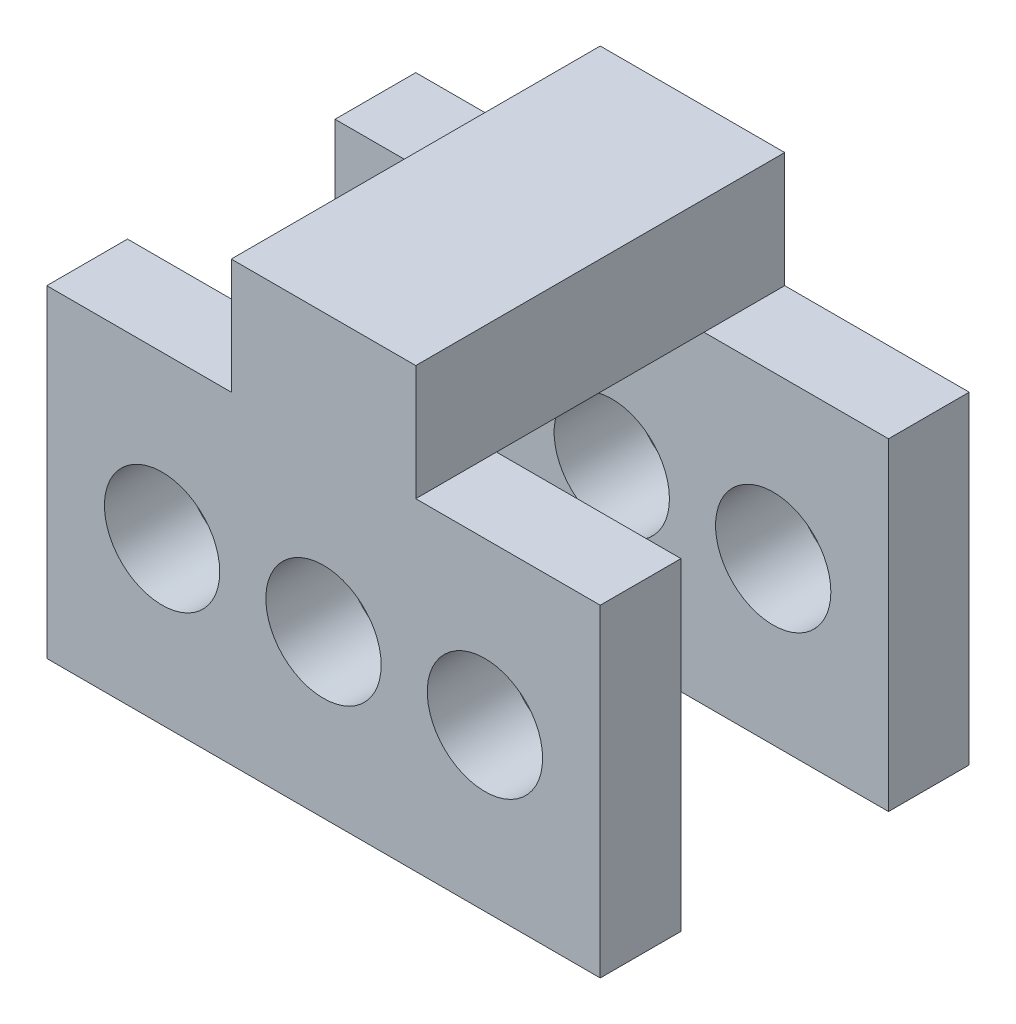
ISO-10303-21;
HEADER;
FILE_DESCRIPTION(('STEP AP214'),'2;1');
FILE_NAME('part.step','',(''),(''),'','','');
FILE_SCHEMA(('AUTOMOTIVE_DESIGN { 1 0 10303 214 1 1 1 1 }'));
ENDSEC;
DATA;
#1=APPLICATION_CONTEXT('core data for automotive mechanical design processes');
#2=APPLICATION_PROTOCOL_DEFINITION('international standard','automotive_design',2000,#1);
#3=PRODUCT_CONTEXT('',#1,'mechanical');
#4=PRODUCT('Part','Part','',(#3));
#5=PRODUCT_RELATED_PRODUCT_CATEGORY('part','',(#4));
#6=PRODUCT_DEFINITION_FORMATION('','',#4);
#7=PRODUCT_DEFINITION_CONTEXT('part definition',#1,'design');
#8=PRODUCT_DEFINITION('design','',#6,#7);
#9=PRODUCT_DEFINITION_SHAPE('','',#8);
#10=(LENGTH_UNIT() NAMED_UNIT(*) SI_UNIT(.MILLI.,.METRE.));
#11=(NAMED_UNIT(*) PLANE_ANGLE_UNIT() SI_UNIT($,.RADIAN.));
#12=(NAMED_UNIT(*) SI_UNIT($,.STERADIAN.) SOLID_ANGLE_UNIT());
#13=UNCERTAINTY_MEASURE_WITH_UNIT(LENGTH_MEASURE(1.E-05),#10,'distance_accuracy_value','');
#14=(GEOMETRIC_REPRESENTATION_CONTEXT(3) GLOBAL_UNCERTAINTY_ASSIGNED_CONTEXT((#13)) GLOBAL_UNIT_ASSIGNED_CONTEXT((#10,
#11,#12)) REPRESENTATION_CONTEXT('',''));
#15=CARTESIAN_POINT('',(0.,0.,0.));
#16=DIRECTION('',(0.,0.,1.));
#17=DIRECTION('',(1.,0.,0.));
#18=AXIS2_PLACEMENT_3D('',#15,#16,#17);
#19=CARTESIAN_POINT('',(-16.,28.,32.));
#20=DIRECTION('',(0.,1.,0.));
#21=DIRECTION('',(0.,0.,1.));
#22=AXIS2_PLACEMENT_3D('',#19,#20,#21);
#23=PLANE('',#22);
#24=DIRECTION('',(-1.,0.,0.));
#25=VECTOR('',#24,1.);
#26=CARTESIAN_POINT('',(-48.,28.,-18.));
#27=LINE('',#26,#25);
#28=CARTESIAN_POINT('',(16.,28.,-18.));
#29=VERTEX_POINT('',#28);
#30=CARTESIAN_POINT('',(-16.,28.,-18.));
#31=VERTEX_POINT('',#30);
#32=EDGE_CURVE('E58',#29,#31,#27,.T.);
#33=ORIENTED_EDGE('',*,*,#32,.F.);
#34=DIRECTION('',(0.,0.,-1.));
#35=VECTOR('',#34,1.);
#36=CARTESIAN_POINT('',(16.,28.,32.));
#37=LINE('',#36,#35);
#38=CARTESIAN_POINT('',(16.,28.,18.));
#39=VERTEX_POINT('',#38);
#40=EDGE_CURVE('E264',#39,#29,#37,.T.);
#41=ORIENTED_EDGE('',*,*,#40,.F.);
#42=DIRECTION('',(-1.,0.,0.));
#43=VECTOR('',#42,1.);
#44=CARTESIAN_POINT('',(-48.,28.,18.));
#45=LINE('',#44,#43);
#46=CARTESIAN_POINT('',(-16.,28.,18.));
#47=VERTEX_POINT('',#46);
#48=EDGE_CURVE('E11',#39,#47,#45,.T.);
#49=ORIENTED_EDGE('',*,*,#48,.T.);
#50=DIRECTION('',(0.,0.,-1.));
#51=VECTOR('',#50,1.);
#52=CARTESIAN_POINT('',(-16.,28.,32.));
#53=LINE('',#52,#51);
#54=EDGE_CURVE('E268',#47,#31,#53,.T.);
#55=ORIENTED_EDGE('',*,*,#54,.T.);
#56=EDGE_LOOP('',(#33,#41,#49,#55));
#57=FACE_BOUND('',#56,.T.);
#58=ADVANCED_FACE('F31',(#57),#23,.F.);
#59=CARTESIAN_POINT('',(16.,28.,32.));
#60=DIRECTION('',(-1.,0.,0.));
#61=DIRECTION('',(0.,-1.,0.));
#62=AXIS2_PLACEMENT_3D('',#59,#60,#61);
#63=PLANE('',#62);
#64=DIRECTION('',(0.,1.,0.));
#65=VECTOR('',#64,1.);
#66=CARTESIAN_POINT('',(16.,28.,-32.));
#67=LINE('',#66,#65);
#68=CARTESIAN_POINT('',(16.,28.,-32.));
#69=VERTEX_POINT('',#68);
#70=CARTESIAN_POINT('',(16.,48.,-32.));
#71=VERTEX_POINT('',#70);
#72=EDGE_CURVE('E248',#69,#71,#67,.T.);
#73=ORIENTED_EDGE('',*,*,#72,.T.);
#74=DIRECTION('',(0.,0.,-1.));
#75=VECTOR('',#74,1.);
#76=CARTESIAN_POINT('',(16.,48.,32.));
#77=LINE('',#76,#75);
#78=CARTESIAN_POINT('',(16.,48.,32.));
#79=VERTEX_POINT('',#78);
#80=EDGE_CURVE('E41',#79,#71,#77,.T.);
#81=ORIENTED_EDGE('',*,*,#80,.F.);
#82=DIRECTION('',(0.,1.,0.));
#83=VECTOR('',#82,1.);
#84=CARTESIAN_POINT('',(16.,28.,32.));
#85=LINE('',#84,#83);
#86=CARTESIAN_POINT('',(16.,28.,32.));
#87=VERTEX_POINT('',#86);
#88=EDGE_CURVE('E263',#87,#79,#85,.T.);
#89=ORIENTED_EDGE('',*,*,#88,.F.);
#90=EDGE_CURVE('E266',#87,#39,#37,.T.);
#91=ORIENTED_EDGE('',*,*,#90,.T.);
#92=ORIENTED_EDGE('',*,*,#40,.T.);
#93=DIRECTION('',(0.,0.,1.));
#94=VECTOR('',#93,1.);
#95=CARTESIAN_POINT('',(16.,28.,32.));
#96=LINE('',#95,#94);
#97=EDGE_CURVE('E189',#69,#29,#96,.T.);
#98=ORIENTED_EDGE('',*,*,#97,.F.);
#99=EDGE_LOOP('',(#73,#81,#89,#91,#92,#98));
#100=FACE_BOUND('',#99,.T.);
#101=ADVANCED_FACE('F33',(#100),#63,.F.);
#102=CARTESIAN_POINT('',(16.,48.,32.));
#103=DIRECTION('',(0.,-1.,0.));
#104=DIRECTION('',(0.,0.,-1.));
#105=AXIS2_PLACEMENT_3D('',#102,#103,#104);
#106=PLANE('',#105);
#107=DIRECTION('',(-1.,0.,0.));
#108=VECTOR('',#107,1.);
#109=CARTESIAN_POINT('',(16.,48.,-32.));
#110=LINE('',#109,#108);
#111=CARTESIAN_POINT('',(-16.,48.,-32.));
#112=VERTEX_POINT('',#111);
#113=EDGE_CURVE('E253',#71,#112,#110,.T.);
#114=ORIENTED_EDGE('',*,*,#113,.T.);
#115=DIRECTION('',(0.,0.,-1.));
#116=VECTOR('',#115,1.);
#117=CARTESIAN_POINT('',(-16.,48.,32.));
#118=LINE('',#117,#116);
#119=CARTESIAN_POINT('',(-16.,48.,32.));
#120=VERTEX_POINT('',#119);
#121=EDGE_CURVE('E291',#120,#112,#118,.T.);
#122=ORIENTED_EDGE('',*,*,#121,.F.);
#123=DIRECTION('',(-1.,0.,0.));
#124=VECTOR('',#123,1.);
#125=CARTESIAN_POINT('',(16.,48.,32.));
#126=LINE('',#125,#124);
#127=EDGE_CURVE('E260',#79,#120,#126,.T.);
#128=ORIENTED_EDGE('',*,*,#127,.F.);
#129=ORIENTED_EDGE('',*,*,#80,.T.);
#130=EDGE_LOOP('',(#114,#122,#128,#129));
#131=FACE_BOUND('',#130,.T.);
#132=ADVANCED_FACE('F292',(#131),#106,.F.);
#133=CARTESIAN_POINT('',(-16.,48.,32.));
#134=DIRECTION('',(1.,0.,0.));
#135=DIRECTION('',(0.,1.,0.));
#136=AXIS2_PLACEMENT_3D('',#133,#134,#135);
#137=PLANE('',#136);
#138=DIRECTION('',(0.,-1.,0.));
#139=VECTOR('',#138,1.);
#140=CARTESIAN_POINT('',(-16.,48.,-32.));
#141=LINE('',#140,#139);
#142=CARTESIAN_POINT('',(-16.,28.,-32.));
#143=VERTEX_POINT('',#142);
#144=EDGE_CURVE('E258',#112,#143,#141,.T.);
#145=ORIENTED_EDGE('',*,*,#144,.T.);
#146=DIRECTION('',(0.,0.,-1.));
#147=VECTOR('',#146,1.);
#148=CARTESIAN_POINT('',(-16.,28.,32.));
#149=LINE('',#148,#147);
#150=EDGE_CURVE('E51',#31,#143,#149,.T.);
#151=ORIENTED_EDGE('',*,*,#150,.F.);
#152=ORIENTED_EDGE('',*,*,#54,.F.);
#153=CARTESIAN_POINT('',(-16.,28.,32.));
#154=VERTEX_POINT('',#153);
#155=EDGE_CURVE('E35',#154,#47,#53,.T.);
#156=ORIENTED_EDGE('',*,*,#155,.F.);
#157=DIRECTION('',(0.,-1.,0.));
#158=VECTOR('',#157,1.);
#159=CARTESIAN_POINT('',(-16.,48.,32.));
#160=LINE('',#159,#158);
#161=EDGE_CURVE('E267',#120,#154,#160,.T.);
#162=ORIENTED_EDGE('',*,*,#161,.F.);
#163=ORIENTED_EDGE('',*,*,#121,.T.);
#164=EDGE_LOOP('',(#145,#151,#152,#156,#162,#163));
#165=FACE_BOUND('',#164,.T.);
#166=ADVANCED_FACE('F294',(#165),#137,.F.);
#167=CARTESIAN_POINT('',(16.,48.,32.));
#168=DIRECTION('',(0.,0.,1.));
#169=DIRECTION('',(1.,0.,0.));
#170=AXIS2_PLACEMENT_3D('',#167,#168,#169);
#171=PLANE('',#170);
#172=ORIENTED_EDGE('',*,*,#88,.T.);
#173=ORIENTED_EDGE('',*,*,#127,.T.);
#174=ORIENTED_EDGE('',*,*,#161,.T.);
#175=DIRECTION('',(-1.,0.,0.));
#176=VECTOR('',#175,1.);
#177=CARTESIAN_POINT('',(-48.,28.,32.));
#178=LINE('',#177,#176);
#179=CARTESIAN_POINT('',(-48.,28.,32.));
#180=VERTEX_POINT('',#179);
#181=EDGE_CURVE('E231',#154,#180,#178,.T.);
#182=ORIENTED_EDGE('',*,*,#181,.T.);
#183=DIRECTION('',(0.,-1.,0.));
#184=VECTOR('',#183,1.);
#185=CARTESIAN_POINT('',(-48.,28.,32.));
#186=LINE('',#185,#184);
#187=CARTESIAN_POINT('',(-48.,-28.,32.));
#188=VERTEX_POINT('',#187);
#189=EDGE_CURVE('E208',#180,#188,#186,.T.);
#190=ORIENTED_EDGE('',*,*,#189,.T.);
#191=DIRECTION('',(1.,0.,0.));
#192=VECTOR('',#191,1.);
#193=CARTESIAN_POINT('',(-48.,-28.,32.));
#194=LINE('',#193,#192);
#195=CARTESIAN_POINT('',(48.,-28.,32.));
#196=VERTEX_POINT('',#195);
#197=EDGE_CURVE('E225',#188,#196,#194,.T.);
#198=ORIENTED_EDGE('',*,*,#197,.T.);
#199=DIRECTION('',(0.,1.,0.));
#200=VECTOR('',#199,1.);
#201=CARTESIAN_POINT('',(48.,28.,32.));
#202=LINE('',#201,#200);
#203=CARTESIAN_POINT('',(48.,28.,32.));
#204=VERTEX_POINT('',#203);
#205=EDGE_CURVE('E228',#196,#204,#202,.T.);
#206=ORIENTED_EDGE('',*,*,#205,.T.);
#207=EDGE_CURVE('E215',#204,#87,#178,.T.);
#208=ORIENTED_EDGE('',*,*,#207,.T.);
#209=EDGE_LOOP('',(#172,#173,#174,#182,#190,#198,#206,#208));
#210=FACE_BOUND('',#209,.T.);
#211=CARTESIAN_POINT('',(28.,0.,32.));
#212=DIRECTION('',(0.,0.,1.));
#213=DIRECTION('',(1.,0.,0.));
#214=AXIS2_PLACEMENT_3D('',#211,#212,#213);
#215=CIRCLE('',#214,10.);
#216=CARTESIAN_POINT('',(38.,0.,32.));
#217=VERTEX_POINT('',#216);
#218=EDGE_CURVE('E192',#217,#217,#215,.T.);
#219=ORIENTED_EDGE('',*,*,#218,.F.);
#220=EDGE_LOOP('',(#219));
#221=FACE_BOUND('',#220,.T.);
#222=CARTESIAN_POINT('',(-28.,0.,32.));
#223=DIRECTION('',(0.,0.,1.));
#224=DIRECTION('',(1.,0.,0.));
#225=AXIS2_PLACEMENT_3D('',#222,#223,#224);
#226=CIRCLE('',#225,10.);
#227=CARTESIAN_POINT('',(-18.,0.,32.));
#228=VERTEX_POINT('',#227);
#229=EDGE_CURVE('E196',#228,#228,#226,.T.);
#230=ORIENTED_EDGE('',*,*,#229,.F.);
#231=EDGE_LOOP('',(#230));
#232=FACE_BOUND('',#231,.T.);
#233=CARTESIAN_POINT('',(0.,0.,32.));
#234=DIRECTION('',(0.,0.,1.));
#235=DIRECTION('',(1.,0.,0.));
#236=AXIS2_PLACEMENT_3D('',#233,#234,#235);
#237=CIRCLE('',#236,10.);
#238=CARTESIAN_POINT('',(10.,0.,32.));
#239=VERTEX_POINT('',#238);
#240=EDGE_CURVE('E202',#239,#239,#237,.T.);
#241=ORIENTED_EDGE('',*,*,#240,.F.);
#242=EDGE_LOOP('',(#241));
#243=FACE_BOUND('',#242,.T.);
#244=ADVANCED_FACE('F285',(#210,#221,#232,#243),#171,.T.);
#245=CARTESIAN_POINT('',(16.,48.,-32.));
#246=DIRECTION('',(0.,0.,1.));
#247=DIRECTION('',(1.,0.,0.));
#248=AXIS2_PLACEMENT_3D('',#245,#246,#247);
#249=PLANE('',#248);
#250=ORIENTED_EDGE('',*,*,#72,.F.);
#251=DIRECTION('',(-1.,0.,0.));
#252=VECTOR('',#251,1.);
#253=CARTESIAN_POINT('',(-48.,28.,-32.));
#254=LINE('',#253,#252);
#255=CARTESIAN_POINT('',(48.,28.,-32.));
#256=VERTEX_POINT('',#255);
#257=EDGE_CURVE('E178',#256,#69,#254,.T.);
#258=ORIENTED_EDGE('',*,*,#257,.F.);
#259=DIRECTION('',(0.,1.,0.));
#260=VECTOR('',#259,1.);
#261=CARTESIAN_POINT('',(48.,28.,-32.));
#262=LINE('',#261,#260);
#263=CARTESIAN_POINT('',(48.,-28.,-32.));
#264=VERTEX_POINT('',#263);
#265=EDGE_CURVE('E166',#264,#256,#262,.T.);
#266=ORIENTED_EDGE('',*,*,#265,.F.);
#267=DIRECTION('',(1.,0.,0.));
#268=VECTOR('',#267,1.);
#269=CARTESIAN_POINT('',(-48.,-28.,-32.));
#270=LINE('',#269,#268);
#271=CARTESIAN_POINT('',(-48.,-28.,-32.));
#272=VERTEX_POINT('',#271);
#273=EDGE_CURVE('E164',#272,#264,#270,.T.);
#274=ORIENTED_EDGE('',*,*,#273,.F.);
#275=DIRECTION('',(0.,-1.,0.));
#276=VECTOR('',#275,1.);
#277=CARTESIAN_POINT('',(-48.,28.,-32.));
#278=LINE('',#277,#276);
#279=CARTESIAN_POINT('',(-48.,28.,-32.));
#280=VERTEX_POINT('',#279);
#281=EDGE_CURVE('E175',#280,#272,#278,.T.);
#282=ORIENTED_EDGE('',*,*,#281,.F.);
#283=EDGE_CURVE('E154',#143,#280,#254,.T.);
#284=ORIENTED_EDGE('',*,*,#283,.F.);
#285=ORIENTED_EDGE('',*,*,#144,.F.);
#286=ORIENTED_EDGE('',*,*,#113,.F.);
#287=EDGE_LOOP('',(#250,#258,#266,#274,#282,#284,#285,#286));
#288=FACE_BOUND('',#287,.T.);
#289=CARTESIAN_POINT('',(-28.,0.,-32.));
#290=DIRECTION('',(0.,0.,1.));
#291=DIRECTION('',(1.,0.,0.));
#292=AXIS2_PLACEMENT_3D('',#289,#290,#291);
#293=CIRCLE('',#292,10.);
#294=CARTESIAN_POINT('',(-18.,0.,-32.));
#295=VERTEX_POINT('',#294);
#296=EDGE_CURVE('E535',#295,#295,#293,.T.);
#297=ORIENTED_EDGE('',*,*,#296,.T.);
#298=EDGE_LOOP('',(#297));
#299=FACE_BOUND('',#298,.T.);
#300=CARTESIAN_POINT('',(0.,0.,-32.));
#301=DIRECTION('',(0.,0.,1.));
#302=DIRECTION('',(1.,0.,0.));
#303=AXIS2_PLACEMENT_3D('',#300,#301,#302);
#304=CIRCLE('',#303,10.);
#305=CARTESIAN_POINT('',(10.,0.,-32.));
#306=VERTEX_POINT('',#305);
#307=EDGE_CURVE('E169',#306,#306,#304,.T.);
#308=ORIENTED_EDGE('',*,*,#307,.T.);
#309=EDGE_LOOP('',(#308));
#310=FACE_BOUND('',#309,.T.);
#311=CARTESIAN_POINT('',(28.,0.,-32.));
#312=DIRECTION('',(0.,0.,1.));
#313=DIRECTION('',(1.,0.,0.));
#314=AXIS2_PLACEMENT_3D('',#311,#312,#313);
#315=CIRCLE('',#314,10.);
#316=CARTESIAN_POINT('',(38.,0.,-32.));
#317=VERTEX_POINT('',#316);
#318=EDGE_CURVE('E532',#317,#317,#315,.T.);
#319=ORIENTED_EDGE('',*,*,#318,.T.);
#320=EDGE_LOOP('',(#319));
#321=FACE_BOUND('',#320,.T.);
#322=ADVANCED_FACE('F322',(#288,#299,#310,#321),#249,.F.);
#323=CARTESIAN_POINT('',(-48.,28.,18.));
#324=DIRECTION('',(0.,1.,0.));
#325=DIRECTION('',(-1.,0.,0.));
#326=AXIS2_PLACEMENT_3D('',#323,#324,#325);
#327=PLANE('',#326);
#328=ORIENTED_EDGE('',*,*,#90,.F.);
#329=ORIENTED_EDGE('',*,*,#207,.F.);
#330=DIRECTION('',(0.,0.,1.));
#331=VECTOR('',#330,1.);
#332=CARTESIAN_POINT('',(48.,28.,18.));
#333=LINE('',#332,#331);
#334=CARTESIAN_POINT('',(48.,28.,18.));
#335=VERTEX_POINT('',#334);
#336=EDGE_CURVE('E244',#335,#204,#333,.T.);
#337=ORIENTED_EDGE('',*,*,#336,.F.);
#338=EDGE_CURVE('E43',#335,#39,#45,.T.);
#339=ORIENTED_EDGE('',*,*,#338,.T.);
#340=EDGE_LOOP('',(#328,#329,#337,#339));
#341=FACE_BOUND('',#340,.T.);
#342=ADVANCED_FACE('F302',(#341),#327,.T.);
#343=CARTESIAN_POINT('',(-48.,28.,18.));
#344=DIRECTION('',(-1.,0.,0.));
#345=DIRECTION('',(0.,-1.,0.));
#346=AXIS2_PLACEMENT_3D('',#343,#344,#345);
#347=PLANE('',#346);
#348=ORIENTED_EDGE('',*,*,#189,.F.);
#349=DIRECTION('',(0.,0.,1.));
#350=VECTOR('',#349,1.);
#351=CARTESIAN_POINT('',(-48.,28.,18.));
#352=LINE('',#351,#350);
#353=CARTESIAN_POINT('',(-48.,28.,18.));
#354=VERTEX_POINT('',#353);
#355=EDGE_CURVE('E234',#354,#180,#352,.T.);
#356=ORIENTED_EDGE('',*,*,#355,.F.);
#357=DIRECTION('',(0.,-1.,0.));
#358=VECTOR('',#357,1.);
#359=CARTESIAN_POINT('',(-48.,28.,18.));
#360=LINE('',#359,#358);
#361=CARTESIAN_POINT('',(-48.,-28.,18.));
#362=VERTEX_POINT('',#361);
#363=EDGE_CURVE('E211',#354,#362,#360,.T.);
#364=ORIENTED_EDGE('',*,*,#363,.T.);
#365=DIRECTION('',(0.,0.,1.));
#366=VECTOR('',#365,1.);
#367=CARTESIAN_POINT('',(-48.,-28.,18.));
#368=LINE('',#367,#366);
#369=EDGE_CURVE('E222',#362,#188,#368,.T.);
#370=ORIENTED_EDGE('',*,*,#369,.T.);
#371=EDGE_LOOP('',(#348,#356,#364,#370));
#372=FACE_BOUND('',#371,.T.);
#373=ADVANCED_FACE('F310',(#372),#347,.T.);
#374=ORIENTED_EDGE('',*,*,#181,.F.);
#375=ORIENTED_EDGE('',*,*,#155,.T.);
#376=EDGE_CURVE('E44',#47,#354,#45,.T.);
#377=ORIENTED_EDGE('',*,*,#376,.T.);
#378=ORIENTED_EDGE('',*,*,#355,.T.);
#379=EDGE_LOOP('',(#374,#375,#377,#378));
#380=FACE_BOUND('',#379,.T.);
#381=ADVANCED_FACE('F311',(#380),#327,.T.);
#382=CARTESIAN_POINT('',(48.,28.,18.));
#383=DIRECTION('',(1.,0.,0.));
#384=DIRECTION('',(0.,1.,0.));
#385=AXIS2_PLACEMENT_3D('',#382,#383,#384);
#386=PLANE('',#385);
#387=ORIENTED_EDGE('',*,*,#205,.F.);
#388=DIRECTION('',(0.,0.,1.));
#389=VECTOR('',#388,1.);
#390=CARTESIAN_POINT('',(48.,-28.,18.));
#391=LINE('',#390,#389);
#392=CARTESIAN_POINT('',(48.,-28.,18.));
#393=VERTEX_POINT('',#392);
#394=EDGE_CURVE('E243',#393,#196,#391,.T.);
#395=ORIENTED_EDGE('',*,*,#394,.F.);
#396=DIRECTION('',(0.,1.,0.));
#397=VECTOR('',#396,1.);
#398=CARTESIAN_POINT('',(48.,28.,18.));
#399=LINE('',#398,#397);
#400=EDGE_CURVE('E218',#393,#335,#399,.T.);
#401=ORIENTED_EDGE('',*,*,#400,.T.);
#402=ORIENTED_EDGE('',*,*,#336,.T.);
#403=EDGE_LOOP('',(#387,#395,#401,#402));
#404=FACE_BOUND('',#403,.T.);
#405=ADVANCED_FACE('F304',(#404),#386,.T.);
#406=CARTESIAN_POINT('',(-48.,-28.,18.));
#407=DIRECTION('',(0.,-1.,0.));
#408=DIRECTION('',(1.,0.,0.));
#409=AXIS2_PLACEMENT_3D('',#406,#407,#408);
#410=PLANE('',#409);
#411=ORIENTED_EDGE('',*,*,#197,.F.);
#412=ORIENTED_EDGE('',*,*,#369,.F.);
#413=DIRECTION('',(1.,0.,0.));
#414=VECTOR('',#413,1.);
#415=CARTESIAN_POINT('',(-48.,-28.,18.));
#416=LINE('',#415,#414);
#417=EDGE_CURVE('E214',#362,#393,#416,.T.);
#418=ORIENTED_EDGE('',*,*,#417,.T.);
#419=ORIENTED_EDGE('',*,*,#394,.T.);
#420=EDGE_LOOP('',(#411,#412,#418,#419));
#421=FACE_BOUND('',#420,.T.);
#422=ADVANCED_FACE('F308',(#421),#410,.T.);
#423=CARTESIAN_POINT('',(-48.,-28.,18.));
#424=DIRECTION('',(0.,0.,1.));
#425=DIRECTION('',(1.,0.,0.));
#426=AXIS2_PLACEMENT_3D('',#423,#424,#425);
#427=PLANE('',#426);
#428=CARTESIAN_POINT('',(28.,0.,18.));
#429=DIRECTION('',(0.,0.,1.));
#430=DIRECTION('',(1.,0.,0.));
#431=AXIS2_PLACEMENT_3D('',#428,#429,#430);
#432=CIRCLE('',#431,10.);
#433=CARTESIAN_POINT('',(38.,0.,18.));
#434=VERTEX_POINT('',#433);
#435=EDGE_CURVE('E193',#434,#434,#432,.T.);
#436=ORIENTED_EDGE('',*,*,#435,.T.);
#437=EDGE_LOOP('',(#436));
#438=FACE_BOUND('',#437,.T.);
#439=CARTESIAN_POINT('',(-28.,0.,18.));
#440=DIRECTION('',(0.,0.,1.));
#441=DIRECTION('',(1.,0.,0.));
#442=AXIS2_PLACEMENT_3D('',#439,#440,#441);
#443=CIRCLE('',#442,10.);
#444=CARTESIAN_POINT('',(-18.,0.,18.));
#445=VERTEX_POINT('',#444);
#446=EDGE_CURVE('E199',#445,#445,#443,.T.);
#447=ORIENTED_EDGE('',*,*,#446,.T.);
#448=EDGE_LOOP('',(#447));
#449=FACE_BOUND('',#448,.T.);
#450=CARTESIAN_POINT('',(0.,0.,18.));
#451=DIRECTION('',(0.,0.,1.));
#452=DIRECTION('',(1.,0.,0.));
#453=AXIS2_PLACEMENT_3D('',#450,#451,#452);
#454=CIRCLE('',#453,10.);
#455=CARTESIAN_POINT('',(10.,0.,18.));
#456=VERTEX_POINT('',#455);
#457=EDGE_CURVE('E205',#456,#456,#454,.T.);
#458=ORIENTED_EDGE('',*,*,#457,.T.);
#459=EDGE_LOOP('',(#458));
#460=FACE_BOUND('',#459,.T.);
#461=ORIENTED_EDGE('',*,*,#363,.F.);
#462=ORIENTED_EDGE('',*,*,#376,.F.);
#463=ORIENTED_EDGE('',*,*,#48,.F.);
#464=ORIENTED_EDGE('',*,*,#338,.F.);
#465=ORIENTED_EDGE('',*,*,#400,.F.);
#466=ORIENTED_EDGE('',*,*,#417,.F.);
#467=EDGE_LOOP('',(#461,#462,#463,#464,#465,#466));
#468=FACE_BOUND('',#467,.T.);
#469=ADVANCED_FACE('F299',(#438,#449,#460,#468),#427,.F.);
#470=CARTESIAN_POINT('',(0.,0.,18.));
#471=DIRECTION('',(0.,0.,1.));
#472=DIRECTION('',(1.,0.,0.));
#473=AXIS2_PLACEMENT_3D('',#470,#471,#472);
#474=CYLINDRICAL_SURFACE('',#473,10.);
#475=ORIENTED_EDGE('',*,*,#457,.F.);
#476=EDGE_LOOP('',(#475));
#477=FACE_BOUND('',#476,.T.);
#478=ORIENTED_EDGE('',*,*,#240,.T.);
#479=EDGE_LOOP('',(#478));
#480=FACE_BOUND('',#479,.T.);
#481=ADVANCED_FACE('F388',(#477,#480),#474,.F.);
#482=CARTESIAN_POINT('',(-28.,0.,18.));
#483=DIRECTION('',(0.,0.,1.));
#484=DIRECTION('',(1.,0.,0.));
#485=AXIS2_PLACEMENT_3D('',#482,#483,#484);
#486=CYLINDRICAL_SURFACE('',#485,10.);
#487=ORIENTED_EDGE('',*,*,#446,.F.);
#488=EDGE_LOOP('',(#487));
#489=FACE_BOUND('',#488,.T.);
#490=ORIENTED_EDGE('',*,*,#229,.T.);
#491=EDGE_LOOP('',(#490));
#492=FACE_BOUND('',#491,.T.);
#493=ADVANCED_FACE('F397',(#489,#492),#486,.F.);
#494=CARTESIAN_POINT('',(28.,0.,18.));
#495=DIRECTION('',(0.,0.,1.));
#496=DIRECTION('',(1.,0.,0.));
#497=AXIS2_PLACEMENT_3D('',#494,#495,#496);
#498=CYLINDRICAL_SURFACE('',#497,10.);
#499=ORIENTED_EDGE('',*,*,#435,.F.);
#500=EDGE_LOOP('',(#499));
#501=FACE_BOUND('',#500,.T.);
#502=ORIENTED_EDGE('',*,*,#218,.T.);
#503=EDGE_LOOP('',(#502));
#504=FACE_BOUND('',#503,.T.);
#505=ADVANCED_FACE('F407',(#501,#504),#498,.F.);
#506=CARTESIAN_POINT('',(-48.,28.,-18.));
#507=DIRECTION('',(0.,-1.,0.));
#508=DIRECTION('',(1.,0.,0.));
#509=AXIS2_PLACEMENT_3D('',#506,#507,#508);
#510=PLANE('',#509);
#511=ORIENTED_EDGE('',*,*,#257,.T.);
#512=ORIENTED_EDGE('',*,*,#97,.T.);
#513=CARTESIAN_POINT('',(48.,28.,-18.));
#514=VERTEX_POINT('',#513);
#515=EDGE_CURVE('E149',#514,#29,#27,.T.);
#516=ORIENTED_EDGE('',*,*,#515,.F.);
#517=DIRECTION('',(0.,0.,-1.));
#518=VECTOR('',#517,1.);
#519=CARTESIAN_POINT('',(48.,28.,-18.));
#520=LINE('',#519,#518);
#521=EDGE_CURVE('E158',#514,#256,#520,.T.);
#522=ORIENTED_EDGE('',*,*,#521,.T.);
#523=EDGE_LOOP('',(#511,#512,#516,#522));
#524=FACE_BOUND('',#523,.T.);
#525=ADVANCED_FACE('F416',(#524),#510,.F.);
#526=CARTESIAN_POINT('',(-48.,28.,-18.));
#527=VERTEX_POINT('',#526);
#528=EDGE_CURVE('E139',#31,#527,#27,.T.);
#529=ORIENTED_EDGE('',*,*,#528,.F.);
#530=ORIENTED_EDGE('',*,*,#150,.T.);
#531=ORIENTED_EDGE('',*,*,#283,.T.);
#532=DIRECTION('',(0.,0.,-1.));
#533=VECTOR('',#532,1.);
#534=CARTESIAN_POINT('',(-48.,28.,-18.));
#535=LINE('',#534,#533);
#536=EDGE_CURVE('E151',#527,#280,#535,.T.);
#537=ORIENTED_EDGE('',*,*,#536,.F.);
#538=EDGE_LOOP('',(#529,#530,#531,#537));
#539=FACE_BOUND('',#538,.T.);
#540=ADVANCED_FACE('F152',(#539),#510,.F.);
#541=CARTESIAN_POINT('',(-48.,-28.,-18.));
#542=DIRECTION('',(0.,0.,-1.));
#543=DIRECTION('',(1.,0.,0.));
#544=AXIS2_PLACEMENT_3D('',#541,#542,#543);
#545=PLANE('',#544);
#546=CARTESIAN_POINT('',(-28.,0.,-18.));
#547=DIRECTION('',(0.,0.,1.));
#548=DIRECTION('',(1.,0.,0.));
#549=AXIS2_PLACEMENT_3D('',#546,#547,#548);
#550=CIRCLE('',#549,10.);
#551=CARTESIAN_POINT('',(-18.,0.,-18.));
#552=VERTEX_POINT('',#551);
#553=EDGE_CURVE('E538',#552,#552,#550,.T.);
#554=ORIENTED_EDGE('',*,*,#553,.F.);
#555=EDGE_LOOP('',(#554));
#556=FACE_BOUND('',#555,.T.);
#557=DIRECTION('',(0.,-1.,0.));
#558=VECTOR('',#557,1.);
#559=CARTESIAN_POINT('',(-48.,28.,-18.));
#560=LINE('',#559,#558);
#561=CARTESIAN_POINT('',(-48.,-28.,-18.));
#562=VERTEX_POINT('',#561);
#563=EDGE_CURVE('E144',#527,#562,#560,.T.);
#564=ORIENTED_EDGE('',*,*,#563,.T.);
#565=DIRECTION('',(1.,0.,0.));
#566=VECTOR('',#565,1.);
#567=CARTESIAN_POINT('',(-48.,-28.,-18.));
#568=LINE('',#567,#566);
#569=CARTESIAN_POINT('',(48.,-28.,-18.));
#570=VERTEX_POINT('',#569);
#571=EDGE_CURVE('E159',#562,#570,#568,.T.);
#572=ORIENTED_EDGE('',*,*,#571,.T.);
#573=DIRECTION('',(0.,1.,0.));
#574=VECTOR('',#573,1.);
#575=CARTESIAN_POINT('',(48.,28.,-18.));
#576=LINE('',#575,#574);
#577=EDGE_CURVE('E172',#570,#514,#576,.T.);
#578=ORIENTED_EDGE('',*,*,#577,.T.);
#579=ORIENTED_EDGE('',*,*,#515,.T.);
#580=ORIENTED_EDGE('',*,*,#32,.T.);
#581=ORIENTED_EDGE('',*,*,#528,.T.);
#582=EDGE_LOOP('',(#564,#572,#578,#579,#580,#581));
#583=FACE_BOUND('',#582,.T.);
#584=CARTESIAN_POINT('',(0.,0.,-18.));
#585=DIRECTION('',(0.,0.,1.));
#586=DIRECTION('',(1.,0.,0.));
#587=AXIS2_PLACEMENT_3D('',#584,#585,#586);
#588=CIRCLE('',#587,10.);
#589=CARTESIAN_POINT('',(10.,0.,-18.));
#590=VERTEX_POINT('',#589);
#591=EDGE_CURVE('E177',#590,#590,#588,.T.);
#592=ORIENTED_EDGE('',*,*,#591,.F.);
#593=EDGE_LOOP('',(#592));
#594=FACE_BOUND('',#593,.T.);
#595=CARTESIAN_POINT('',(28.,0.,-18.));
#596=DIRECTION('',(0.,0.,1.));
#597=DIRECTION('',(1.,0.,0.));
#598=AXIS2_PLACEMENT_3D('',#595,#596,#597);
#599=CIRCLE('',#598,10.);
#600=CARTESIAN_POINT('',(38.,0.,-18.));
#601=VERTEX_POINT('',#600);
#602=EDGE_CURVE('E529',#601,#601,#599,.T.);
#603=ORIENTED_EDGE('',*,*,#602,.F.);
#604=EDGE_LOOP('',(#603));
#605=FACE_BOUND('',#604,.T.);
#606=ADVANCED_FACE('F141',(#556,#583,#594,#605),#545,.F.);
#607=CARTESIAN_POINT('',(-48.,28.,-18.));
#608=DIRECTION('',(1.,0.,0.));
#609=DIRECTION('',(0.,1.,0.));
#610=AXIS2_PLACEMENT_3D('',#607,#608,#609);
#611=PLANE('',#610);
#612=ORIENTED_EDGE('',*,*,#281,.T.);
#613=DIRECTION('',(0.,0.,-1.));
#614=VECTOR('',#613,1.);
#615=CARTESIAN_POINT('',(-48.,-28.,-18.));
#616=LINE('',#615,#614);
#617=EDGE_CURVE('E163',#562,#272,#616,.T.);
#618=ORIENTED_EDGE('',*,*,#617,.F.);
#619=ORIENTED_EDGE('',*,*,#563,.F.);
#620=ORIENTED_EDGE('',*,*,#536,.T.);
#621=EDGE_LOOP('',(#612,#618,#619,#620));
#622=FACE_BOUND('',#621,.T.);
#623=ADVANCED_FACE('F161',(#622),#611,.F.);
#624=CARTESIAN_POINT('',(-48.,-28.,-18.));
#625=DIRECTION('',(0.,1.,0.));
#626=DIRECTION('',(-1.,0.,0.));
#627=AXIS2_PLACEMENT_3D('',#624,#625,#626);
#628=PLANE('',#627);
#629=ORIENTED_EDGE('',*,*,#273,.T.);
#630=DIRECTION('',(0.,0.,-1.));
#631=VECTOR('',#630,1.);
#632=CARTESIAN_POINT('',(48.,-28.,-18.));
#633=LINE('',#632,#631);
#634=EDGE_CURVE('E183',#570,#264,#633,.T.);
#635=ORIENTED_EDGE('',*,*,#634,.F.);
#636=ORIENTED_EDGE('',*,*,#571,.F.);
#637=ORIENTED_EDGE('',*,*,#617,.T.);
#638=EDGE_LOOP('',(#629,#635,#636,#637));
#639=FACE_BOUND('',#638,.T.);
#640=ADVANCED_FACE('F471',(#639),#628,.F.);
#641=CARTESIAN_POINT('',(48.,28.,-18.));
#642=DIRECTION('',(-1.,0.,0.));
#643=DIRECTION('',(0.,-1.,0.));
#644=AXIS2_PLACEMENT_3D('',#641,#642,#643);
#645=PLANE('',#644);
#646=ORIENTED_EDGE('',*,*,#265,.T.);
#647=ORIENTED_EDGE('',*,*,#521,.F.);
#648=ORIENTED_EDGE('',*,*,#577,.F.);
#649=ORIENTED_EDGE('',*,*,#634,.T.);
#650=EDGE_LOOP('',(#646,#647,#648,#649));
#651=FACE_BOUND('',#650,.T.);
#652=ADVANCED_FACE('F479',(#651),#645,.F.);
#653=CARTESIAN_POINT('',(0.,0.,-18.));
#654=DIRECTION('',(0.,0.,-1.));
#655=DIRECTION('',(-1.,0.,0.));
#656=AXIS2_PLACEMENT_3D('',#653,#654,#655);
#657=CYLINDRICAL_SURFACE('',#656,10.);
#658=ORIENTED_EDGE('',*,*,#591,.T.);
#659=EDGE_LOOP('',(#658));
#660=FACE_BOUND('',#659,.T.);
#661=ORIENTED_EDGE('',*,*,#307,.F.);
#662=EDGE_LOOP('',(#661));
#663=FACE_BOUND('',#662,.T.);
#664=ADVANCED_FACE('F488',(#660,#663),#657,.F.);
#665=CARTESIAN_POINT('',(-28.,0.,-18.));
#666=DIRECTION('',(0.,0.,-1.));
#667=DIRECTION('',(-1.,0.,0.));
#668=AXIS2_PLACEMENT_3D('',#665,#666,#667);
#669=CYLINDRICAL_SURFACE('',#668,10.);
#670=ORIENTED_EDGE('',*,*,#553,.T.);
#671=EDGE_LOOP('',(#670));
#672=FACE_BOUND('',#671,.T.);
#673=ORIENTED_EDGE('',*,*,#296,.F.);
#674=EDGE_LOOP('',(#673));
#675=FACE_BOUND('',#674,.T.);
#676=ADVANCED_FACE('F497',(#672,#675),#669,.F.);
#677=CARTESIAN_POINT('',(28.,0.,-18.));
#678=DIRECTION('',(0.,0.,-1.));
#679=DIRECTION('',(-1.,0.,0.));
#680=AXIS2_PLACEMENT_3D('',#677,#678,#679);
#681=CYLINDRICAL_SURFACE('',#680,10.);
#682=ORIENTED_EDGE('',*,*,#602,.T.);
#683=EDGE_LOOP('',(#682));
#684=FACE_BOUND('',#683,.T.);
#685=ORIENTED_EDGE('',*,*,#318,.F.);
#686=EDGE_LOOP('',(#685));
#687=FACE_BOUND('',#686,.T.);
#688=ADVANCED_FACE('F506',(#684,#687),#681,.F.);
#689=CLOSED_SHELL('',(#58,#101,#132,#166,#244,#322,#342,#373,#381,#405,#422,#469,#481,#493,#505,
#525,#540,#606,#623,#640,#652,#664,#676,#688));
#690=MANIFOLD_SOLID_BREP('B2',#689);
#691=ADVANCED_BREP_SHAPE_REPRESENTATION('',(#18,#690),#14);
#692=SHAPE_DEFINITION_REPRESENTATION(#9,#691);
ENDSEC;
END-ISO-10303-21;
